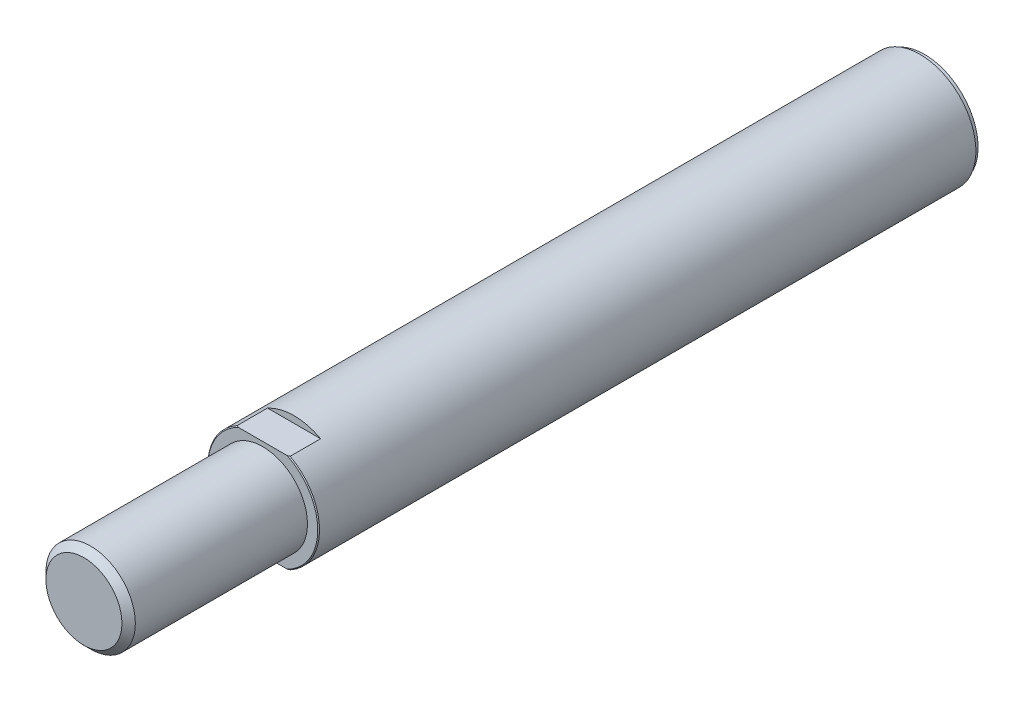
from build123d import *

# Parameters (mm, degrees)
ESBO_O1_R                       = 12.5
RESSALTO_EXTRUS_O1_DEPTH        = 188
ESBO_O2_OUTSIDE_W               = 65.26
ESBO_O2_OUTSIDE_H               = 65.26
ESBO_O2_OUTSIDE_R               = 10
CORTE_EXTRUS_O1_DEPTH           = 40
CHANFRO1_SIZE                   = 0.2
ESBO_O3_OUTSIDE_W               = 65.26
ESBO_O3_OUTSIDE_H               = 65.26
ESBO_O3_OUTSIDE_W_2             = 37.9352264
ESBO_O3_OUTSIDE_H_2             = 22
CORTE_EXTRUS_O2_DEPTH           = 7
CHANFRO2_SIZE                   = 1.5
ESBO_O4_OUTSIDE_W               = 65.26
ESBO_O4_OUTSIDE_H               = 65.26
ESBO_O4_OUTSIDE_R               = 12
CORTE_EXTRUS_O3_DEPTH           = 1
FURO_ROSCADO_DE_M12X1_751_D     = 10.2
FURO_ROSCADO_DE_M12X1_751_DEPTH = 32.75
FURO_ROSCADO_DE_M12X1_751_TIP   = 3.064389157


with BuildPart() as part:
    # Esbo_o1 → Ressalto-extrus_o1 (new body)
    with BuildSketch(Plane.XY):
        Circle(ESBO_O1_R)
    extrude(amount=RESSALTO_EXTRUS_O1_DEPTH)

    # Esbo_o2 outside → Corte-extrus_o1 (cut)
    with BuildSketch(Plane.XY.offset(188)):
        Rectangle(ESBO_O2_OUTSIDE_W, ESBO_O2_OUTSIDE_H)
        Circle(ESBO_O2_OUTSIDE_R, mode=Mode.SUBTRACT)
    extrude(amount=-CORTE_EXTRUS_O1_DEPTH, mode=Mode.SUBTRACT)

    # Chanfro1
    chanfro1_edges = [part.edges().sort_by_distance(p)[0] for p in [
        (-12.5, 0, 148),
    ]]
    chamfer(chanfro1_edges, length=CHANFRO1_SIZE)

    # Esbo_o3 outside → Corte-extrus_o2 (cut)
    with BuildSketch(Plane.XY.offset(148)):
        Rectangle(ESBO_O3_OUTSIDE_W, ESBO_O3_OUTSIDE_H)
        Rectangle(ESBO_O3_OUTSIDE_W_2, ESBO_O3_OUTSIDE_H_2, mode=Mode.SUBTRACT)
    extrude(amount=-CORTE_EXTRUS_O2_DEPTH, mode=Mode.SUBTRACT)

    # Chanfro2
    chanfro2_edges = [part.edges().sort_by_distance(p)[0] for p in [
        (-10, 0, 188),
    ]]
    chamfer(chanfro2_edges, length=CHANFRO2_SIZE)

    # Esbo_o4 outside → Corte-extrus_o3 (cut)
    with BuildSketch(Plane(origin=(0, 0, 0), x_dir=(-1, 0, 0), z_dir=(0, 0, -1))):
        Rectangle(ESBO_O4_OUTSIDE_W, ESBO_O4_OUTSIDE_H)
        Circle(ESBO_O4_OUTSIDE_R, mode=Mode.SUBTRACT)
    extrude(amount=-CORTE_EXTRUS_O3_DEPTH, mode=Mode.SUBTRACT)

    # Furo roscado de M12x1.751
    with Locations(Plane(origin=(0, 0, 0), x_dir=(-1, 0, 0), z_dir=(0, 0, -1))):
        with Locations((0, 0)):
            Hole(FURO_ROSCADO_DE_M12X1_751_D / 2, depth=FURO_ROSCADO_DE_M12X1_751_DEPTH)
            with Locations((0, 0, -(FURO_ROSCADO_DE_M12X1_751_DEPTH + FURO_ROSCADO_DE_M12X1_751_TIP / 2))):  # 118° drill point
                Cone(0, FURO_ROSCADO_DE_M12X1_751_D / 2, FURO_ROSCADO_DE_M12X1_751_TIP, mode=Mode.SUBTRACT)


solid = part.part
